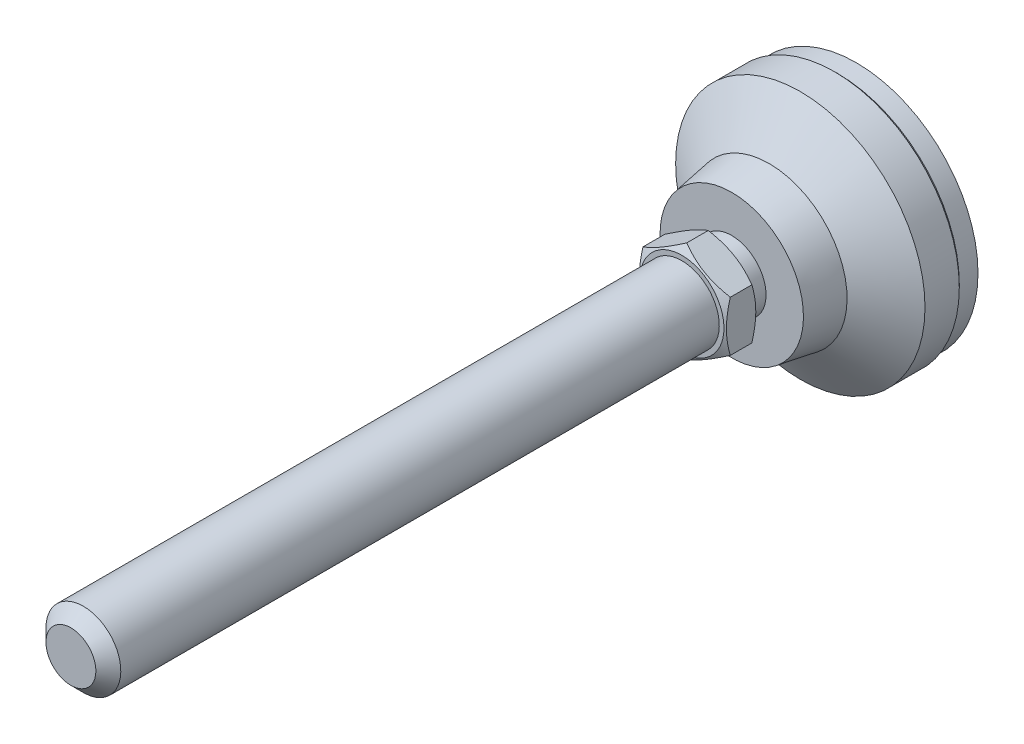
ISO-10303-21;
HEADER;
FILE_DESCRIPTION(('STEP AP214'),'2;1');
FILE_NAME('part.step','',(''),(''),'','','');
FILE_SCHEMA(('AUTOMOTIVE_DESIGN { 1 0 10303 214 1 1 1 1 }'));
ENDSEC;
DATA;
#1=APPLICATION_CONTEXT('core data for automotive mechanical design processes');
#2=APPLICATION_PROTOCOL_DEFINITION('international standard','automotive_design',2000,#1);
#3=PRODUCT_CONTEXT('',#1,'mechanical');
#4=PRODUCT('Part','Part','',(#3));
#5=PRODUCT_RELATED_PRODUCT_CATEGORY('part','',(#4));
#6=PRODUCT_DEFINITION_FORMATION('','',#4);
#7=PRODUCT_DEFINITION_CONTEXT('part definition',#1,'design');
#8=PRODUCT_DEFINITION('design','',#6,#7);
#9=PRODUCT_DEFINITION_SHAPE('','',#8);
#10=(LENGTH_UNIT() NAMED_UNIT(*) SI_UNIT(.MILLI.,.METRE.));
#11=(NAMED_UNIT(*) PLANE_ANGLE_UNIT() SI_UNIT($,.RADIAN.));
#12=(NAMED_UNIT(*) SI_UNIT($,.STERADIAN.) SOLID_ANGLE_UNIT());
#13=UNCERTAINTY_MEASURE_WITH_UNIT(LENGTH_MEASURE(1.E-05),#10,'distance_accuracy_value','');
#14=(GEOMETRIC_REPRESENTATION_CONTEXT(3) GLOBAL_UNCERTAINTY_ASSIGNED_CONTEXT((#13)) GLOBAL_UNIT_ASSIGNED_CONTEXT((#10,
#11,#12)) REPRESENTATION_CONTEXT('',''));
#15=CARTESIAN_POINT('',(0.,0.,0.));
#16=DIRECTION('',(0.,0.,1.));
#17=DIRECTION('',(1.,0.,0.));
#18=AXIS2_PLACEMENT_3D('',#15,#16,#17);
#19=CARTESIAN_POINT('',(0.,0.,1.99999999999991));
#20=DIRECTION('',(0.,0.,-1.));
#21=DIRECTION('',(0.,1.,0.));
#22=AXIS2_PLACEMENT_3D('',#19,#20,#21);
#23=CYLINDRICAL_SURFACE('',#22,20.);
#24=CARTESIAN_POINT('',(0.,0.,3.5));
#25=DIRECTION('',(0.,0.,-1.));
#26=DIRECTION('',(0.,1.,0.));
#27=AXIS2_PLACEMENT_3D('',#24,#25,#26);
#28=CIRCLE('',#27,20.);
#29=CARTESIAN_POINT('',(0.,20.,3.5));
#30=VERTEX_POINT('',#29);
#31=EDGE_CURVE('E114',#30,#30,#28,.F.);
#32=ORIENTED_EDGE('',*,*,#31,.T.);
#33=EDGE_LOOP('',(#32));
#34=FACE_BOUND('',#33,.T.);
#35=CARTESIAN_POINT('',(0.,0.,9.));
#36=DIRECTION('',(0.,0.,-1.));
#37=DIRECTION('',(0.,1.,0.));
#38=AXIS2_PLACEMENT_3D('',#35,#36,#37);
#39=CIRCLE('',#38,20.);
#40=CARTESIAN_POINT('',(0.,20.,9.));
#41=VERTEX_POINT('',#40);
#42=EDGE_CURVE('E108',#41,#41,#39,.T.);
#43=ORIENTED_EDGE('',*,*,#42,.T.);
#44=EDGE_LOOP('',(#43));
#45=FACE_BOUND('',#44,.T.);
#46=ADVANCED_FACE('F14',(#34,#45),#23,.T.);
#47=CARTESIAN_POINT('',(0.,0.,14.));
#48=DIRECTION('',(0.,0.,-1.));
#49=DIRECTION('',(0.,1.,0.));
#50=AXIS2_PLACEMENT_3D('',#47,#48,#49);
#51=CONICAL_SURFACE('',#50,12.5,0.98279372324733);
#52=ORIENTED_EDGE('',*,*,#42,.F.);
#53=EDGE_LOOP('',(#52));
#54=FACE_BOUND('',#53,.T.);
#55=CARTESIAN_POINT('',(0.,0.,14.));
#56=DIRECTION('',(0.,0.,-1.));
#57=DIRECTION('',(0.,1.,0.));
#58=AXIS2_PLACEMENT_3D('',#55,#56,#57);
#59=CIRCLE('',#58,12.5);
#60=CARTESIAN_POINT('',(0.,12.5,14.));
#61=VERTEX_POINT('',#60);
#62=EDGE_CURVE('E105',#61,#61,#59,.T.);
#63=ORIENTED_EDGE('',*,*,#62,.T.);
#64=EDGE_LOOP('',(#63));
#65=FACE_BOUND('',#64,.T.);
#66=ADVANCED_FACE('F226',(#54,#65),#51,.T.);
#67=CARTESIAN_POINT('',(0.,0.,20.));
#68=DIRECTION('',(0.,0.,-1.));
#69=DIRECTION('',(0.,1.,0.));
#70=AXIS2_PLACEMENT_3D('',#67,#68,#69);
#71=CONICAL_SURFACE('',#70,11.5,0.165148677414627);
#72=ORIENTED_EDGE('',*,*,#62,.F.);
#73=EDGE_LOOP('',(#72));
#74=FACE_BOUND('',#73,.T.);
#75=CARTESIAN_POINT('',(0.,0.,20.));
#76=DIRECTION('',(0.,0.,-1.));
#77=DIRECTION('',(0.,1.,0.));
#78=AXIS2_PLACEMENT_3D('',#75,#76,#77);
#79=CIRCLE('',#78,11.5);
#80=CARTESIAN_POINT('',(0.,11.5,20.));
#81=VERTEX_POINT('',#80);
#82=EDGE_CURVE('E102',#81,#81,#79,.T.);
#83=ORIENTED_EDGE('',*,*,#82,.T.);
#84=EDGE_LOOP('',(#83));
#85=FACE_BOUND('',#84,.T.);
#86=ADVANCED_FACE('F222',(#74,#85),#71,.T.);
#87=CARTESIAN_POINT('',(-11.5,0.,20.));
#88=DIRECTION('',(0.,0.,-1.));
#89=DIRECTION('',(0.,1.,0.));
#90=AXIS2_PLACEMENT_3D('',#87,#88,#89);
#91=PLANE('',#90);
#92=ORIENTED_EDGE('',*,*,#82,.F.);
#93=EDGE_LOOP('',(#92));
#94=FACE_BOUND('',#93,.T.);
#95=CARTESIAN_POINT('',(0.,0.,20.));
#96=DIRECTION('',(0.,0.,-1.));
#97=DIRECTION('',(0.,1.,0.));
#98=AXIS2_PLACEMENT_3D('',#95,#96,#97);
#99=CIRCLE('',#98,5.49999999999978);
#100=CARTESIAN_POINT('',(0.,5.49999999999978,20.));
#101=VERTEX_POINT('',#100);
#102=EDGE_CURVE('E99',#101,#101,#99,.T.);
#103=ORIENTED_EDGE('',*,*,#102,.T.);
#104=EDGE_LOOP('',(#103));
#105=FACE_BOUND('',#104,.T.);
#106=ADVANCED_FACE('F218',(#94,#105),#91,.F.);
#107=CARTESIAN_POINT('',(0.,0.,1.99999999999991));
#108=DIRECTION('',(0.,0.,-1.));
#109=DIRECTION('',(0.,1.,0.));
#110=AXIS2_PLACEMENT_3D('',#107,#108,#109);
#111=CYLINDRICAL_SURFACE('',#110,5.49999999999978);
#112=ORIENTED_EDGE('',*,*,#102,.F.);
#113=EDGE_LOOP('',(#112));
#114=FACE_BOUND('',#113,.T.);
#115=CARTESIAN_POINT('',(0.,0.,23.));
#116=DIRECTION('',(0.,0.,-1.));
#117=DIRECTION('',(0.,1.,0.));
#118=AXIS2_PLACEMENT_3D('',#115,#116,#117);
#119=CIRCLE('',#118,5.49999999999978);
#120=CARTESIAN_POINT('',(0.,5.49999999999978,23.));
#121=VERTEX_POINT('',#120);
#122=EDGE_CURVE('E96',#121,#121,#119,.T.);
#123=ORIENTED_EDGE('',*,*,#122,.T.);
#124=EDGE_LOOP('',(#123));
#125=FACE_BOUND('',#124,.T.);
#126=ADVANCED_FACE('F214',(#114,#125),#111,.T.);
#127=CARTESIAN_POINT('',(-5.49999999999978,0.,23.));
#128=DIRECTION('',(0.,0.,1.));
#129=DIRECTION('',(0.,-1.,0.));
#130=AXIS2_PLACEMENT_3D('',#127,#128,#129);
#131=PLANE('',#130);
#132=CARTESIAN_POINT('',(0.,0.,23.));
#133=DIRECTION('',(0.,0.,1.));
#134=DIRECTION('',(0.,-1.,0.));
#135=AXIS2_PLACEMENT_3D('',#132,#133,#134);
#136=CIRCLE('',#135,6.75);
#137=CARTESIAN_POINT('',(0.,-6.75,23.));
#138=VERTEX_POINT('',#137);
#139=EDGE_CURVE('E305',#138,#138,#136,.T.);
#140=ORIENTED_EDGE('',*,*,#139,.F.);
#141=EDGE_LOOP('',(#140));
#142=FACE_BOUND('',#141,.T.);
#143=ORIENTED_EDGE('',*,*,#122,.F.);
#144=EDGE_LOOP('',(#143));
#145=FACE_BOUND('',#144,.T.);
#146=ADVANCED_FACE('F211',(#142,#145),#131,.F.);
#147=CARTESIAN_POINT('',(0.,0.,3.));
#148=DIRECTION('',(0.,0.,1.));
#149=DIRECTION('',(0.,-1.,0.));
#150=AXIS2_PLACEMENT_3D('',#147,#148,#149);
#151=CONICAL_SURFACE('',#150,19.5,0.785398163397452);
#152=ORIENTED_EDGE('',*,*,#31,.F.);
#153=EDGE_LOOP('',(#152));
#154=FACE_BOUND('',#153,.T.);
#155=CARTESIAN_POINT('',(0.,0.,3.));
#156=DIRECTION('',(0.,0.,-1.));
#157=DIRECTION('',(0.,1.,0.));
#158=AXIS2_PLACEMENT_3D('',#155,#156,#157);
#159=CIRCLE('',#158,19.5);
#160=CARTESIAN_POINT('',(0.,19.5,3.));
#161=VERTEX_POINT('',#160);
#162=EDGE_CURVE('E111',#161,#161,#159,.T.);
#163=ORIENTED_EDGE('',*,*,#162,.F.);
#164=EDGE_LOOP('',(#163));
#165=FACE_BOUND('',#164,.T.);
#166=ADVANCED_FACE('F16',(#154,#165),#151,.T.);
#167=CARTESIAN_POINT('',(0.,0.,0.));
#168=DIRECTION('',(0.,0.,1.));
#169=DIRECTION('',(0.,-1.,0.));
#170=AXIS2_PLACEMENT_3D('',#167,#168,#169);
#171=CYLINDRICAL_SURFACE('',#170,19.5);
#172=CARTESIAN_POINT('',(0.,0.,0.));
#173=DIRECTION('',(0.,0.,-1.));
#174=DIRECTION('',(0.,1.,0.));
#175=AXIS2_PLACEMENT_3D('',#172,#173,#174);
#176=CIRCLE('',#175,19.5);
#177=CARTESIAN_POINT('',(0.,19.5,0.));
#178=VERTEX_POINT('',#177);
#179=EDGE_CURVE('E278',#178,#178,#176,.T.);
#180=ORIENTED_EDGE('',*,*,#179,.F.);
#181=EDGE_LOOP('',(#180));
#182=FACE_BOUND('',#181,.T.);
#183=ORIENTED_EDGE('',*,*,#162,.T.);
#184=EDGE_LOOP('',(#183));
#185=FACE_BOUND('',#184,.T.);
#186=ADVANCED_FACE('F251',(#182,#185),#171,.T.);
#187=CARTESIAN_POINT('',(0.,0.,0.));
#188=DIRECTION('',(0.,0.,-1.));
#189=DIRECTION('',(0.,1.,0.));
#190=AXIS2_PLACEMENT_3D('',#187,#188,#189);
#191=PLANE('',#190);
#192=ORIENTED_EDGE('',*,*,#179,.T.);
#193=EDGE_LOOP('',(#192));
#194=FACE_BOUND('',#193,.T.);
#195=ADVANCED_FACE('F134',(#194),#191,.T.);
#196=CARTESIAN_POINT('',(0.,0.,23.));
#197=DIRECTION('',(0.,0.,1.));
#198=DIRECTION('',(0.,-1.,0.));
#199=AXIS2_PLACEMENT_3D('',#196,#197,#198);
#200=CONICAL_SURFACE('',#199,6.75,1.0471975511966);
#201=CARTESIAN_POINT('',(0.000200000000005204,-8.08301923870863,23.7696190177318));
#202=CARTESIAN_POINT('',(-0.153667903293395,-7.99418356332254,23.7183374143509));
#203=CARTESIAN_POINT('',(-0.308109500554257,-7.90501666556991,23.669383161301));
#204=CARTESIAN_POINT('',(-0.618246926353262,-7.72595873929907,23.5767703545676));
#205=CARTESIAN_POINT('',(-0.773943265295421,-7.63606741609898,23.5331140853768));
#206=CARTESIAN_POINT('',(-1.24352516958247,-7.36495417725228,23.4109491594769));
#207=CARTESIAN_POINT('',(-1.55926433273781,-7.18266208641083,23.3414631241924));
#208=CARTESIAN_POINT('',(-2.03176224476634,-6.90986528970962,23.2599825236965));
#209=CARTESIAN_POINT('',(-2.1871092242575,-6.82017566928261,23.2367710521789));
#210=CARTESIAN_POINT('',(-2.49850511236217,-6.64039116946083,23.1978487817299));
#211=CARTESIAN_POINT('',(-2.65455395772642,-6.55029632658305,23.1821373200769));
#212=CARTESIAN_POINT('',(-2.96692267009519,-6.36995016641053,23.1586154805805));
#213=CARTESIAN_POINT('',(-3.12324202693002,-6.27969914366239,23.1507961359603));
#214=CARTESIAN_POINT('',(-3.43601650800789,-6.09911871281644,23.1432178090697));
#215=CARTESIAN_POINT('',(-3.59247162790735,-6.00878930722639,23.1434585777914));
#216=CARTESIAN_POINT('',(-4.02110687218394,-5.76131663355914,23.1551972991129));
#217=CARTESIAN_POINT('',(-4.2931466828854,-5.60425437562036,23.1749033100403));
#218=CARTESIAN_POINT('',(-4.83541944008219,-5.29117305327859,23.2373910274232));
#219=CARTESIAN_POINT('',(-5.10565047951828,-5.13515508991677,23.2801940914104));
#220=CARTESIAN_POINT('',(-5.64901454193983,-4.82144370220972,23.3871892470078));
#221=CARTESIAN_POINT('',(-5.92207900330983,-4.66378986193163,23.4518346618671));
#222=CARTESIAN_POINT('',(-6.46413578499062,-4.35083323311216,23.5985536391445));
#223=CARTESIAN_POINT('',(-6.73313504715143,-4.19552643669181,23.680592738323));
#224=CARTESIAN_POINT('',(-7.0002,-4.04133641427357,23.7696190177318));
#225=B_SPLINE_CURVE_WITH_KNOTS('',3,(#201,#202,#203,#204,#205,#206,#207,#208,#209,#210,#211,
#212,#213,#214,#215,#216,#217,#218,#219,#220,#221,#222,#223,#224),.UNSPECIFIED.,.F.,.F.,(4,2,2,
2,2,2,2,2,2,2,2,4),(0.,0.554727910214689,1.10969417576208,2.2219327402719,2.76443041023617,
3.30688013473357,3.8487128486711,4.39052882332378,5.33376515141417,6.27787517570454,
7.24292418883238,8.20607866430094),.UNSPECIFIED.);
#226=CARTESIAN_POINT('',(0.,-8.08290376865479,23.7695523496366));
#227=VERTEX_POINT('',#226);
#228=CARTESIAN_POINT('',(-7.,-4.04145188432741,23.7695523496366));
#229=VERTEX_POINT('',#228);
#230=EDGE_CURVE('E73',#227,#229,#225,.T.);
#231=ORIENTED_EDGE('',*,*,#230,.T.);
#232=CARTESIAN_POINT('',(-7.,10.8348937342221,26.5503667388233));
#233=CARTESIAN_POINT('',(-7.,10.5293318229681,26.4022261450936));
#234=CARTESIAN_POINT('',(-7.,10.2230662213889,26.2555120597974));
#235=CARTESIAN_POINT('',(-7.,9.60875332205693,25.9657396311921));
#236=CARTESIAN_POINT('',(-7.,9.30070575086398,25.8226818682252));
#237=CARTESIAN_POINT('',(-7.,8.68085739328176,25.540300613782));
#238=CARTESIAN_POINT('',(-7.,8.36904529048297,25.4010018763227));
#239=CARTESIAN_POINT('',(-7.,7.74293373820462,25.1281330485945));
#240=CARTESIAN_POINT('',(-7.,7.4286344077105,24.9945626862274));
#241=CARTESIAN_POINT('',(-7.,6.78698608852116,24.7305231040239));
#242=CARTESIAN_POINT('',(-7.,6.4595402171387,24.6002880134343));
#243=CARTESIAN_POINT('',(-7.,5.80081065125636,24.3497252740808));
#244=CARTESIAN_POINT('',(-7.,5.46952652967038,24.229398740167));
#245=CARTESIAN_POINT('',(-7.,4.80321625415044,24.0018276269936));
#246=CARTESIAN_POINT('',(-7.,4.46819930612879,23.8945563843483));
#247=CARTESIAN_POINT('',(-7.,3.79337198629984,23.6965503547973));
#248=CARTESIAN_POINT('',(-7.,3.4535631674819,23.6058103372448));
#249=CARTESIAN_POINT('',(-7.,2.77078372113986,23.4457225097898));
#250=CARTESIAN_POINT('',(-7.,2.42784084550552,23.3762595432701));
#251=CARTESIAN_POINT('',(-7.,1.91032039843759,23.2910407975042));
#252=CARTESIAN_POINT('',(-7.,1.73728303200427,23.2657960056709));
#253=CARTESIAN_POINT('',(-7.,1.39035535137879,23.222127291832));
#254=CARTESIAN_POINT('',(-7.,1.2164651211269,23.203702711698));
#255=CARTESIAN_POINT('',(-7.,0.870327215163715,23.1742714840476));
#256=CARTESIAN_POINT('',(-7.,0.698087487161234,23.1631717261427));
#257=CARTESIAN_POINT('',(-7.,0.35329310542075,23.1482643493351));
#258=CARTESIAN_POINT('',(-7.,0.180738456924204,23.1444566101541));
#259=CARTESIAN_POINT('',(-7.,-0.164377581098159,23.1442240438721));
#260=CARTESIAN_POINT('',(-7.,-0.33693897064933,23.1477992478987));
#261=CARTESIAN_POINT('',(-7.,-0.681758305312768,23.1622455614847));
#262=CARTESIAN_POINT('',(-7.,-0.854016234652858,23.1731170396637));
#263=CARTESIAN_POINT('',(-7.,-1.26863959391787,23.2078365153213));
#264=CARTESIAN_POINT('',(-7.,-1.51071829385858,23.2351816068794));
#265=CARTESIAN_POINT('',(-7.,-1.99305383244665,23.3027847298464));
#266=CARTESIAN_POINT('',(-7.,-2.23331041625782,23.3430445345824));
#267=CARTESIAN_POINT('',(-7.,-2.95108635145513,23.4810590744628));
#268=CARTESIAN_POINT('',(-7.,-3.42533906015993,23.5960230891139));
#269=CARTESIAN_POINT('',(-7.,-4.13444792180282,23.7950671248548));
#270=CARTESIAN_POINT('',(-7.,-4.3729900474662,23.8667681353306));
#271=CARTESIAN_POINT('',(-7.,-4.84775684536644,24.0175391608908));
#272=CARTESIAN_POINT('',(-7.,-5.08398150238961,24.0966092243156));
#273=CARTESIAN_POINT('',(-7.,-5.55418919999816,24.260856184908));
#274=CARTESIAN_POINT('',(-7.,-5.78817296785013,24.3460310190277));
#275=CARTESIAN_POINT('',(-7.,-6.25420710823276,24.5214931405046));
#276=CARTESIAN_POINT('',(-7.,-6.48625750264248,24.611780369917));
#277=CARTESIAN_POINT('',(-7.,-7.03079375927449,24.8294575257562));
#278=CARTESIAN_POINT('',(-7.,-7.34256475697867,24.9586323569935));
#279=CARTESIAN_POINT('',(-7.,-7.96348332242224,25.2231582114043));
#280=CARTESIAN_POINT('',(-7.,-8.27263073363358,25.3585096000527));
#281=CARTESIAN_POINT('',(-7.,-8.88878070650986,25.6341566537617));
#282=CARTESIAN_POINT('',(-7.,-9.19578283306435,25.7744532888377));
#283=CARTESIAN_POINT('',(-7.,-9.80794886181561,26.0590082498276));
#284=CARTESIAN_POINT('',(-7.,-10.1131127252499,26.2032666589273));
#285=CARTESIAN_POINT('',(-7.,-10.7222145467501,26.4951564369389));
#286=CARTESIAN_POINT('',(-7.,-11.0261508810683,26.6427911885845));
#287=CARTESIAN_POINT('',(-7.,-11.6327197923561,26.9407175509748));
#288=CARTESIAN_POINT('',(-7.,-11.9353523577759,27.0910091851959));
#289=CARTESIAN_POINT('',(-7.,-12.8415253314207,27.5451278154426));
#290=CARTESIAN_POINT('',(-7.,-13.4434207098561,27.8522370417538));
#291=CARTESIAN_POINT('',(-7.,-14.594154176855,28.4468576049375));
#292=CARTESIAN_POINT('',(-7.,-15.1432469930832,28.7338781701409));
#293=CARTESIAN_POINT('',(-7.,-16.2393904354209,29.3118355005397));
#294=CARTESIAN_POINT('',(-7.,-16.7864409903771,29.6027724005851));
#295=CARTESIAN_POINT('',(-7.,-17.8776073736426,30.1869146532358));
#296=CARTESIAN_POINT('',(-7.,-18.4217271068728,30.4801127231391));
#297=CARTESIAN_POINT('',(-7.,-19.5086591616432,31.0688532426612));
#298=CARTESIAN_POINT('',(-7.,-20.0514715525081,31.3643955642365));
#299=CARTESIAN_POINT('',(-7.,-20.5938019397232,31.6608138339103));
#300=B_SPLINE_CURVE_WITH_KNOTS('',3,(#232,#233,#234,#235,#236,#237,#238,#239,#240,#241,#242,
#243,#244,#245,#246,#247,#248,#249,#250,#251,#252,#253,#254,#255,#256,#257,#258,#259,#260,#261,
#262,#263,#264,#265,#266,#267,#268,#269,#270,#271,#272,#273,#274,#275,#276,#277,#278,#279,#280,
#281,#282,#283,#284,#285,#286,#287,#288,#289,#290,#291,#292,#293,#294,#295,#296,#297,#298,#299),
.UNSPECIFIED.,.F.,.F.,(4,2,2,2,2,2,2,2,2,2,2,2,2,2,2,2,2,2,2,2,2,2,2,2,2,2,2,2,2,2,2,2,2,4),(0.,
1.01874874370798,2.03765819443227,3.06215014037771,4.08659336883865,5.14365285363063,
6.2008311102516,7.25581266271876,8.31045982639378,9.35929379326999,9.88378805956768,
10.4082317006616,10.9258733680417,11.4435064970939,11.9611418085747,12.4788032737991,
13.2092448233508,13.9397867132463,15.4016889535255,16.1488828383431,16.8960816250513,
17.6430290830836,18.3899680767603,19.4022943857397,20.4146806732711,21.4272666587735,
22.4398739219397,23.4535444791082,24.4672239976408,26.4943175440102,28.3530512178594,
30.211849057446,32.0661035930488,33.9202575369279),.UNSPECIFIED.);
#301=CARTESIAN_POINT('',(-7.,4.04145188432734,23.7695523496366));
#302=VERTEX_POINT('',#301);
#303=EDGE_CURVE('E81',#229,#302,#300,.F.);
#304=ORIENTED_EDGE('',*,*,#303,.T.);
#305=CARTESIAN_POINT('',(-7.0002,4.0413364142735,23.7696190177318));
#306=CARTESIAN_POINT('',(-6.8463320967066,4.13017208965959,23.7183374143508));
#307=CARTESIAN_POINT('',(-6.69189049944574,4.21933898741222,23.669383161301));
#308=CARTESIAN_POINT('',(-6.38175307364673,4.39839691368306,23.5767703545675));
#309=CARTESIAN_POINT('',(-6.22605673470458,4.48828823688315,23.5331140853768));
#310=CARTESIAN_POINT('',(-5.75647483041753,4.75940147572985,23.4109491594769));
#311=CARTESIAN_POINT('',(-5.44073566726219,4.94169356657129,23.3414631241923));
#312=CARTESIAN_POINT('',(-4.96823775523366,5.2144903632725,23.2599825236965));
#313=CARTESIAN_POINT('',(-4.81289077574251,5.30417998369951,23.2367710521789));
#314=CARTESIAN_POINT('',(-4.50149488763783,5.48396448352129,23.1978487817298));
#315=CARTESIAN_POINT('',(-4.34544604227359,5.57405932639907,23.1821373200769));
#316=CARTESIAN_POINT('',(-4.03307732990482,5.75440548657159,23.1586154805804));
#317=CARTESIAN_POINT('',(-3.87675797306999,5.84465650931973,23.1507961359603));
#318=CARTESIAN_POINT('',(-3.56398349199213,6.02523694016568,23.1432178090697));
#319=CARTESIAN_POINT('',(-3.40752837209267,6.11556634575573,23.1434585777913));
#320=CARTESIAN_POINT('',(-2.97889312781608,6.36303901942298,23.1551972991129));
#321=CARTESIAN_POINT('',(-2.70685331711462,6.52010127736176,23.1749033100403));
#322=CARTESIAN_POINT('',(-2.16458055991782,6.83318259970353,23.2373910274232));
#323=CARTESIAN_POINT('',(-1.89434952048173,6.98920056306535,23.2801940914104));
#324=CARTESIAN_POINT('',(-1.35098545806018,7.3029119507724,23.3871892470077));
#325=CARTESIAN_POINT('',(-1.07792099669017,7.4605657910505,23.4518346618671));
#326=CARTESIAN_POINT('',(-0.53586421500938,7.77352241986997,23.5985536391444));
#327=CARTESIAN_POINT('',(-0.266864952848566,7.92882921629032,23.6805927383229));
#328=CARTESIAN_POINT('',(0.000200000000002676,8.08301923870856,23.7696190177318));
#329=B_SPLINE_CURVE_WITH_KNOTS('',3,(#305,#306,#307,#308,#309,#310,#311,#312,#313,#314,#315,
#316,#317,#318,#319,#320,#321,#322,#323,#324,#325,#326,#327,#328),.UNSPECIFIED.,.F.,.F.,(4,2,2,
2,2,2,2,2,2,2,2,4),(0.,0.554727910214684,1.10969417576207,2.22193274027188,2.76443041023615,
3.30688013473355,3.84871284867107,4.39052882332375,5.33376515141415,6.27787517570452,
7.24292418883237,8.20607866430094),.UNSPECIFIED.);
#330=CARTESIAN_POINT('',(0.,8.08290376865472,23.7695523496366));
#331=VERTEX_POINT('',#330);
#332=EDGE_CURVE('E193',#302,#331,#329,.T.);
#333=ORIENTED_EDGE('',*,*,#332,.T.);
#334=CARTESIAN_POINT('',(-0.000199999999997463,8.08301923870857,23.7696190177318));
#335=CARTESIAN_POINT('',(0.153667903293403,7.99418356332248,23.7183374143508));
#336=CARTESIAN_POINT('',(0.308109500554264,7.90501666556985,23.669383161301));
#337=CARTESIAN_POINT('',(0.618246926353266,7.72595873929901,23.5767703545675));
#338=CARTESIAN_POINT('',(0.773943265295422,7.63606741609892,23.5331140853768));
#339=CARTESIAN_POINT('',(1.24352516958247,7.36495417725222,23.4109491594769));
#340=CARTESIAN_POINT('',(1.55926433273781,7.18266208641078,23.3414631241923));
#341=CARTESIAN_POINT('',(2.03176224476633,6.90986528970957,23.2599825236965));
#342=CARTESIAN_POINT('',(2.18710922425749,6.82017566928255,23.2367710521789));
#343=CARTESIAN_POINT('',(2.49850511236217,6.64039116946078,23.1978487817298));
#344=CARTESIAN_POINT('',(2.65455395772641,6.550296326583,23.1821373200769));
#345=CARTESIAN_POINT('',(2.96692267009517,6.36995016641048,23.1586154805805));
#346=CARTESIAN_POINT('',(3.12324202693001,6.27969914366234,23.1507961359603));
#347=CARTESIAN_POINT('',(3.43601650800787,6.09911871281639,23.1432178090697));
#348=CARTESIAN_POINT('',(3.59247162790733,6.00878930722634,23.1434585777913));
#349=CARTESIAN_POINT('',(4.02110687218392,5.76131663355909,23.1551972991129));
#350=CARTESIAN_POINT('',(4.29314668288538,5.60425437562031,23.1749033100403));
#351=CARTESIAN_POINT('',(4.83541944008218,5.29117305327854,23.2373910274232));
#352=CARTESIAN_POINT('',(5.10565047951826,5.13515508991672,23.2801940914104));
#353=CARTESIAN_POINT('',(5.64901454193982,4.82144370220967,23.3871892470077));
#354=CARTESIAN_POINT('',(5.92207900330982,4.66378986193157,23.4518346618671));
#355=CARTESIAN_POINT('',(6.46413578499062,4.35083323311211,23.5985536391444));
#356=CARTESIAN_POINT('',(6.73313504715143,4.19552643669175,23.6805927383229));
#357=CARTESIAN_POINT('',(7.0002,4.04133641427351,23.7696190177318));
#358=B_SPLINE_CURVE_WITH_KNOTS('',3,(#334,#335,#336,#337,#338,#339,#340,#341,#342,#343,#344,
#345,#346,#347,#348,#349,#350,#351,#352,#353,#354,#355,#356,#357),.UNSPECIFIED.,.F.,.F.,(4,2,2,
2,2,2,2,2,2,2,2,4),(0.,0.554727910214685,1.10969417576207,2.22193274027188,2.76443041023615,
3.30688013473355,3.84871284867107,4.39052882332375,5.33376515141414,6.27787517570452,
7.24292418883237,8.20607866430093),.UNSPECIFIED.);
#359=CARTESIAN_POINT('',(7.,4.04145188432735,23.7695523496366));
#360=VERTEX_POINT('',#359);
#361=EDGE_CURVE('E304',#331,#360,#358,.T.);
#362=ORIENTED_EDGE('',*,*,#361,.T.);
#363=CARTESIAN_POINT('',(7.,10.8348937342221,26.5503667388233));
#364=CARTESIAN_POINT('',(7.,10.5293318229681,26.4022261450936));
#365=CARTESIAN_POINT('',(7.,10.2230662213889,26.2555120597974));
#366=CARTESIAN_POINT('',(7.,9.60875332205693,25.9657396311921));
#367=CARTESIAN_POINT('',(7.,9.30070575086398,25.8226818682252));
#368=CARTESIAN_POINT('',(7.,8.68085739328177,25.540300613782));
#369=CARTESIAN_POINT('',(7.,8.36904529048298,25.4010018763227));
#370=CARTESIAN_POINT('',(7.,7.74293373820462,25.1281330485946));
#371=CARTESIAN_POINT('',(7.,7.4286344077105,24.9945626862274));
#372=CARTESIAN_POINT('',(7.,6.78698608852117,24.7305231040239));
#373=CARTESIAN_POINT('',(7.,6.4595402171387,24.6002880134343));
#374=CARTESIAN_POINT('',(7.,5.80081065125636,24.3497252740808));
#375=CARTESIAN_POINT('',(7.,5.46952652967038,24.229398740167));
#376=CARTESIAN_POINT('',(7.,4.80321625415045,24.0018276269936));
#377=CARTESIAN_POINT('',(7.,4.46819930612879,23.8945563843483));
#378=CARTESIAN_POINT('',(7.,3.79337198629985,23.6965503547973));
#379=CARTESIAN_POINT('',(7.,3.4535631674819,23.6058103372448));
#380=CARTESIAN_POINT('',(7.,2.77078372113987,23.4457225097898));
#381=CARTESIAN_POINT('',(7.,2.42784084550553,23.3762595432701));
#382=CARTESIAN_POINT('',(7.,1.91032039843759,23.2910407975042));
#383=CARTESIAN_POINT('',(7.,1.73728303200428,23.2657960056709));
#384=CARTESIAN_POINT('',(7.,1.3903553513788,23.222127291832));
#385=CARTESIAN_POINT('',(7.,1.2164651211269,23.203702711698));
#386=CARTESIAN_POINT('',(7.,0.87032721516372,23.1742714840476));
#387=CARTESIAN_POINT('',(7.,0.698087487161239,23.1631717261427));
#388=CARTESIAN_POINT('',(7.,0.353293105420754,23.1482643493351));
#389=CARTESIAN_POINT('',(7.,0.180738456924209,23.1444566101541));
#390=CARTESIAN_POINT('',(7.,-0.164377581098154,23.1442240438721));
#391=CARTESIAN_POINT('',(7.,-0.336938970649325,23.1477992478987));
#392=CARTESIAN_POINT('',(7.,-0.681758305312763,23.1622455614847));
#393=CARTESIAN_POINT('',(7.,-0.854016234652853,23.1731170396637));
#394=CARTESIAN_POINT('',(7.,-1.26863959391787,23.2078365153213));
#395=CARTESIAN_POINT('',(7.,-1.51071829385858,23.2351816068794));
#396=CARTESIAN_POINT('',(7.,-1.99305383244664,23.3027847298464));
#397=CARTESIAN_POINT('',(7.,-2.23331041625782,23.3430445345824));
#398=CARTESIAN_POINT('',(7.,-2.95108635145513,23.4810590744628));
#399=CARTESIAN_POINT('',(7.,-3.42533906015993,23.5960230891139));
#400=CARTESIAN_POINT('',(7.,-4.13444792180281,23.7950671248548));
#401=CARTESIAN_POINT('',(7.,-4.37299004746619,23.8667681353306));
#402=CARTESIAN_POINT('',(7.,-4.84775684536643,24.0175391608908));
#403=CARTESIAN_POINT('',(7.,-5.08398150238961,24.0966092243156));
#404=CARTESIAN_POINT('',(7.,-5.55418919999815,24.260856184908));
#405=CARTESIAN_POINT('',(7.,-5.78817296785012,24.3460310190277));
#406=CARTESIAN_POINT('',(7.,-6.25420710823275,24.5214931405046));
#407=CARTESIAN_POINT('',(7.,-6.48625750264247,24.611780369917));
#408=CARTESIAN_POINT('',(7.,-7.03079375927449,24.8294575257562));
#409=CARTESIAN_POINT('',(7.,-7.34256475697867,24.9586323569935));
#410=CARTESIAN_POINT('',(7.,-7.96348332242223,25.2231582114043));
#411=CARTESIAN_POINT('',(7.,-8.27263073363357,25.3585096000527));
#412=CARTESIAN_POINT('',(7.,-8.88878070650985,25.6341566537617));
#413=CARTESIAN_POINT('',(7.,-9.19578283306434,25.7744532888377));
#414=CARTESIAN_POINT('',(7.,-9.80794886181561,26.0590082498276));
#415=CARTESIAN_POINT('',(7.,-10.1131127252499,26.2032666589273));
#416=CARTESIAN_POINT('',(7.,-10.7222145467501,26.4951564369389));
#417=CARTESIAN_POINT('',(7.,-11.0261508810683,26.6427911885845));
#418=CARTESIAN_POINT('',(7.,-11.6327197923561,26.9407175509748));
#419=CARTESIAN_POINT('',(7.,-11.9353523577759,27.0910091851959));
#420=CARTESIAN_POINT('',(7.,-12.8415253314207,27.5451278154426));
#421=CARTESIAN_POINT('',(7.,-13.4434207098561,27.8522370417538));
#422=CARTESIAN_POINT('',(7.,-14.594154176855,28.4468576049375));
#423=CARTESIAN_POINT('',(7.,-15.1432469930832,28.7338781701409));
#424=CARTESIAN_POINT('',(7.,-16.2393904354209,29.3118355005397));
#425=CARTESIAN_POINT('',(7.,-16.7864409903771,29.6027724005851));
#426=CARTESIAN_POINT('',(7.,-17.8776073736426,30.1869146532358));
#427=CARTESIAN_POINT('',(7.,-18.4217271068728,30.4801127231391));
#428=CARTESIAN_POINT('',(7.,-19.5086591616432,31.0688532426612));
#429=CARTESIAN_POINT('',(7.,-20.0514715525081,31.3643955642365));
#430=CARTESIAN_POINT('',(7.,-20.5938019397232,31.6608138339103));
#431=B_SPLINE_CURVE_WITH_KNOTS('',3,(#363,#364,#365,#366,#367,#368,#369,#370,#371,#372,#373,
#374,#375,#376,#377,#378,#379,#380,#381,#382,#383,#384,#385,#386,#387,#388,#389,#390,#391,#392,
#393,#394,#395,#396,#397,#398,#399,#400,#401,#402,#403,#404,#405,#406,#407,#408,#409,#410,#411,
#412,#413,#414,#415,#416,#417,#418,#419,#420,#421,#422,#423,#424,#425,#426,#427,#428,#429,#430),
.UNSPECIFIED.,.F.,.F.,(4,2,2,2,2,2,2,2,2,2,2,2,2,2,2,2,2,2,2,2,2,2,2,2,2,2,2,2,2,2,2,2,2,4),(0.,
1.01874874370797,2.03765819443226,3.0621501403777,4.08659336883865,5.14365285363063,
6.20083111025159,7.25581266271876,8.31045982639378,9.35929379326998,9.88378805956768,
10.4082317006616,10.9258733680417,11.4435064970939,11.9611418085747,12.4788032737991,
13.2092448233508,13.9397867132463,15.4016889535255,16.1488828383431,16.8960816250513,
17.6430290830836,18.3899680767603,19.4022943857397,20.4146806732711,21.4272666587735,
22.4398739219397,23.4535444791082,24.4672239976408,26.4943175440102,28.3530512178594,
30.211849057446,32.0661035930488,33.9202575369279),.UNSPECIFIED.);
#432=CARTESIAN_POINT('',(7.,-4.04145188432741,23.7695523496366));
#433=VERTEX_POINT('',#432);
#434=EDGE_CURVE('E34',#360,#433,#431,.T.);
#435=ORIENTED_EDGE('',*,*,#434,.T.);
#436=CARTESIAN_POINT('',(7.0002,-4.04133641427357,23.7696190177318));
#437=CARTESIAN_POINT('',(6.8463320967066,-4.13017208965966,23.7183374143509));
#438=CARTESIAN_POINT('',(6.69189049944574,-4.2193389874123,23.669383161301));
#439=CARTESIAN_POINT('',(6.38175307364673,-4.39839691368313,23.5767703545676));
#440=CARTESIAN_POINT('',(6.22605673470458,-4.48828823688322,23.5331140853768));
#441=CARTESIAN_POINT('',(5.75647483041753,-4.75940147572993,23.4109491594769));
#442=CARTESIAN_POINT('',(5.44073566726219,-4.94169356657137,23.3414631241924));
#443=CARTESIAN_POINT('',(4.96823775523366,-5.21449036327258,23.2599825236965));
#444=CARTESIAN_POINT('',(4.8128907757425,-5.30417998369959,23.2367710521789));
#445=CARTESIAN_POINT('',(4.50149488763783,-5.48396448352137,23.1978487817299));
#446=CARTESIAN_POINT('',(4.34544604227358,-5.57405932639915,23.1821373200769));
#447=CARTESIAN_POINT('',(4.03307732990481,-5.75440548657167,23.1586154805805));
#448=CARTESIAN_POINT('',(3.87675797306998,-5.84465650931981,23.1507961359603));
#449=CARTESIAN_POINT('',(3.56398349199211,-6.02523694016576,23.1432178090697));
#450=CARTESIAN_POINT('',(3.40752837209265,-6.11556634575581,23.1434585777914));
#451=CARTESIAN_POINT('',(2.97889312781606,-6.36303901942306,23.1551972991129));
#452=CARTESIAN_POINT('',(2.7068533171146,-6.52010127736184,23.1749033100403));
#453=CARTESIAN_POINT('',(2.16458055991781,-6.83318259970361,23.2373910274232));
#454=CARTESIAN_POINT('',(1.89434952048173,-6.98920056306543,23.2801940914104));
#455=CARTESIAN_POINT('',(1.35098545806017,-7.30291195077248,23.3871892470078));
#456=CARTESIAN_POINT('',(1.07792099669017,-7.46056579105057,23.4518346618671));
#457=CARTESIAN_POINT('',(0.535864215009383,-7.77352241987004,23.5985536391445));
#458=CARTESIAN_POINT('',(0.266864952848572,-7.92882921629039,23.680592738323));
#459=CARTESIAN_POINT('',(-0.000199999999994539,-8.08301923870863,23.7696190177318));
#460=B_SPLINE_CURVE_WITH_KNOTS('',3,(#436,#437,#438,#439,#440,#441,#442,#443,#444,#445,#446,
#447,#448,#449,#450,#451,#452,#453,#454,#455,#456,#457,#458,#459),.UNSPECIFIED.,.F.,.F.,(4,2,2,
2,2,2,2,2,2,2,2,4),(0.,0.554727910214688,1.10969417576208,2.22193274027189,2.76443041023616,
3.30688013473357,3.84871284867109,4.39052882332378,5.33376515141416,6.27787517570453,
7.24292418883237,8.20607866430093),.UNSPECIFIED.);
#461=EDGE_CURVE('E9',#433,#227,#460,.T.);
#462=ORIENTED_EDGE('',*,*,#461,.T.);
#463=EDGE_LOOP('',(#231,#304,#333,#362,#435,#462));
#464=FACE_BOUND('',#463,.T.);
#465=ORIENTED_EDGE('',*,*,#139,.T.);
#466=EDGE_LOOP('',(#465));
#467=FACE_BOUND('',#466,.T.);
#468=ADVANCED_FACE('F71',(#464,#467),#200,.T.);
#469=CARTESIAN_POINT('',(0.,0.,126.));
#470=DIRECTION('',(0.,0.,-1.));
#471=DIRECTION('',(0.,1.,0.));
#472=AXIS2_PLACEMENT_3D('',#469,#470,#471);
#473=PLANE('',#472);
#474=CARTESIAN_POINT('',(0.,0.,126.));
#475=DIRECTION('',(0.,0.,-1.));
#476=DIRECTION('',(0.,1.,0.));
#477=AXIS2_PLACEMENT_3D('',#474,#475,#476);
#478=CIRCLE('',#477,4.);
#479=CARTESIAN_POINT('',(0.,4.,126.));
#480=VERTEX_POINT('',#479);
#481=EDGE_CURVE('E87',#480,#480,#478,.T.);
#482=ORIENTED_EDGE('',*,*,#481,.F.);
#483=EDGE_LOOP('',(#482));
#484=FACE_BOUND('',#483,.T.);
#485=ADVANCED_FACE('F183',(#484),#473,.F.);
#486=CARTESIAN_POINT('',(0.,0.,126.));
#487=DIRECTION('',(0.,0.,-1.));
#488=DIRECTION('',(0.,1.,0.));
#489=AXIS2_PLACEMENT_3D('',#486,#487,#488);
#490=CONICAL_SURFACE('',#489,4.,0.785398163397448);
#491=CARTESIAN_POINT('',(0.,0.,124.));
#492=DIRECTION('',(0.,0.,-1.));
#493=DIRECTION('',(0.,1.,0.));
#494=AXIS2_PLACEMENT_3D('',#491,#492,#493);
#495=CIRCLE('',#494,6.);
#496=CARTESIAN_POINT('',(0.,6.,124.));
#497=VERTEX_POINT('',#496);
#498=EDGE_CURVE('E92',#497,#497,#495,.T.);
#499=ORIENTED_EDGE('',*,*,#498,.F.);
#500=EDGE_LOOP('',(#499));
#501=FACE_BOUND('',#500,.T.);
#502=ORIENTED_EDGE('',*,*,#481,.T.);
#503=EDGE_LOOP('',(#502));
#504=FACE_BOUND('',#503,.T.);
#505=ADVANCED_FACE('F264',(#501,#504),#490,.T.);
#506=CARTESIAN_POINT('',(0.,0.,-4.74975615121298));
#507=DIRECTION('',(0.,0.,-1.));
#508=DIRECTION('',(0.,1.,0.));
#509=AXIS2_PLACEMENT_3D('',#506,#507,#508);
#510=CYLINDRICAL_SURFACE('',#509,6.);
#511=CARTESIAN_POINT('',(0.,0.,28.));
#512=DIRECTION('',(0.,0.,-1.));
#513=DIRECTION('',(0.,1.,0.));
#514=AXIS2_PLACEMENT_3D('',#511,#512,#513);
#515=CIRCLE('',#514,6.);
#516=CARTESIAN_POINT('',(0.,6.,28.));
#517=VERTEX_POINT('',#516);
#518=EDGE_CURVE('E117',#517,#517,#515,.F.);
#519=ORIENTED_EDGE('',*,*,#518,.T.);
#520=EDGE_LOOP('',(#519));
#521=FACE_BOUND('',#520,.T.);
#522=ORIENTED_EDGE('',*,*,#498,.T.);
#523=EDGE_LOOP('',(#522));
#524=FACE_BOUND('',#523,.T.);
#525=ADVANCED_FACE('F209',(#521,#524),#510,.T.);
#526=CARTESIAN_POINT('',(-3.99999999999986,0.,28.));
#527=DIRECTION('',(0.,0.,-1.));
#528=DIRECTION('',(0.,1.,0.));
#529=AXIS2_PLACEMENT_3D('',#526,#527,#528);
#530=PLANE('',#529);
#531=CARTESIAN_POINT('',(0.,0.,28.));
#532=DIRECTION('',(0.,0.,1.));
#533=DIRECTION('',(0.,-1.,0.));
#534=AXIS2_PLACEMENT_3D('',#531,#532,#533);
#535=CIRCLE('',#534,6.75);
#536=CARTESIAN_POINT('',(0.,-6.75,28.));
#537=VERTEX_POINT('',#536);
#538=EDGE_CURVE('E80',#537,#537,#535,.T.);
#539=ORIENTED_EDGE('',*,*,#538,.T.);
#540=EDGE_LOOP('',(#539));
#541=FACE_BOUND('',#540,.T.);
#542=ORIENTED_EDGE('',*,*,#518,.F.);
#543=EDGE_LOOP('',(#542));
#544=FACE_BOUND('',#543,.T.);
#545=ADVANCED_FACE('F131',(#541,#544),#530,.F.);
#546=CARTESIAN_POINT('',(0.,0.,26.2502690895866));
#547=DIRECTION('',(0.,0.,-1.));
#548=DIRECTION('',(0.,1.,0.));
#549=AXIS2_PLACEMENT_3D('',#546,#547,#548);
#550=CONICAL_SURFACE('',#549,9.78062283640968,1.0471975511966);
#551=CARTESIAN_POINT('',(-7.0002,-4.04133641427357,27.230380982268));
#552=CARTESIAN_POINT('',(-6.84633209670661,-4.13017208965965,27.281662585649));
#553=CARTESIAN_POINT('',(-6.69189049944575,-4.21933898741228,27.3306168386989));
#554=CARTESIAN_POINT('',(-6.38175307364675,-4.39839691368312,27.4232296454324));
#555=CARTESIAN_POINT('',(-6.22605673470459,-4.48828823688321,27.4668859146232));
#556=CARTESIAN_POINT('',(-5.75647483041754,-4.75940147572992,27.589050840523));
#557=CARTESIAN_POINT('',(-5.4407356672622,-4.94169356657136,27.6585368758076));
#558=CARTESIAN_POINT('',(-4.96823775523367,-5.21449036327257,27.7400174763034));
#559=CARTESIAN_POINT('',(-4.81289077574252,-5.30417998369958,27.7632289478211));
#560=CARTESIAN_POINT('',(-4.50149488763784,-5.48396448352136,27.8021512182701));
#561=CARTESIAN_POINT('',(-4.34544604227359,-5.57405932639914,27.817862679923));
#562=CARTESIAN_POINT('',(-4.03307732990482,-5.75440548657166,27.8413845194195));
#563=CARTESIAN_POINT('',(-3.87675797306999,-5.8446565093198,27.8492038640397));
#564=CARTESIAN_POINT('',(-3.56398349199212,-6.02523694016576,27.8567821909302));
#565=CARTESIAN_POINT('',(-3.40752837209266,-6.11556634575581,27.8565414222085));
#566=CARTESIAN_POINT('',(-2.97889312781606,-6.36303901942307,27.8448027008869));
#567=CARTESIAN_POINT('',(-2.70685331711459,-6.52010127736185,27.8250966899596));
#568=CARTESIAN_POINT('',(-2.16458055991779,-6.83318259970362,27.7626089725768));
#569=CARTESIAN_POINT('',(-1.89434952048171,-6.98920056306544,27.7198059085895));
#570=CARTESIAN_POINT('',(-1.35098545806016,-7.30291195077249,27.6128107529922));
#571=CARTESIAN_POINT('',(-1.07792099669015,-7.46056579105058,27.5481653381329));
#572=CARTESIAN_POINT('',(-0.535864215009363,-7.77352241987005,27.4014463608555));
#573=CARTESIAN_POINT('',(-0.266864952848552,-7.9288292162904,27.319407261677));
#574=CARTESIAN_POINT('',(0.000200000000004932,-8.08301923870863,27.230380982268));
#575=B_SPLINE_CURVE_WITH_KNOTS('',3,(#551,#552,#553,#554,#555,#556,#557,#558,#559,#560,#561,
#562,#563,#564,#565,#566,#567,#568,#569,#570,#571,#572,#573,#574),.UNSPECIFIED.,.F.,.F.,(4,2,2,
2,2,2,2,2,2,2,2,4),(0.,0.554727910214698,1.1096941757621,2.22193274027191,2.76443041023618,
3.30688013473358,3.84871284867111,4.3905288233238,5.3337651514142,6.27787517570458,
7.24292418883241,8.20607866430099),.UNSPECIFIED.);
#576=CARTESIAN_POINT('',(-7.,-4.04145188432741,27.2304476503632));
#577=VERTEX_POINT('',#576);
#578=CARTESIAN_POINT('',(0.,-8.08290376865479,27.2304476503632));
#579=VERTEX_POINT('',#578);
#580=EDGE_CURVE('E171',#577,#579,#575,.T.);
#581=ORIENTED_EDGE('',*,*,#580,.T.);
#582=CARTESIAN_POINT('',(-0.000199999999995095,-8.08301923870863,27.230380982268));
#583=CARTESIAN_POINT('',(0.153667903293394,-7.99418356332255,27.281662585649));
#584=CARTESIAN_POINT('',(0.308109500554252,-7.90501666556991,27.3306168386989));
#585=CARTESIAN_POINT('',(0.618246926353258,-7.72595873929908,27.4232296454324));
#586=CARTESIAN_POINT('',(0.77394326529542,-7.63606741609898,27.4668859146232));
#587=CARTESIAN_POINT('',(1.24352516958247,-7.36495417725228,27.589050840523));
#588=CARTESIAN_POINT('',(1.55926433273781,-7.18266208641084,27.6585368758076));
#589=CARTESIAN_POINT('',(2.03176224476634,-6.90986528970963,27.7400174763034));
#590=CARTESIAN_POINT('',(2.18710922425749,-6.82017566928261,27.7632289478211));
#591=CARTESIAN_POINT('',(2.49850511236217,-6.64039116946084,27.8021512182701));
#592=CARTESIAN_POINT('',(2.65455395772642,-6.55029632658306,27.817862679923));
#593=CARTESIAN_POINT('',(2.96692267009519,-6.36995016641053,27.8413845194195));
#594=CARTESIAN_POINT('',(3.12324202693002,-6.27969914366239,27.8492038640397));
#595=CARTESIAN_POINT('',(3.43601650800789,-6.09911871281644,27.8567821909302));
#596=CARTESIAN_POINT('',(3.59247162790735,-6.00878930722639,27.8565414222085));
#597=CARTESIAN_POINT('',(4.02110687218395,-5.76131663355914,27.8448027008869));
#598=CARTESIAN_POINT('',(4.29314668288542,-5.60425437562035,27.8250966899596));
#599=CARTESIAN_POINT('',(4.83541944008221,-5.29117305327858,27.7626089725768));
#600=CARTESIAN_POINT('',(5.1056504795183,-5.13515508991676,27.7198059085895));
#601=CARTESIAN_POINT('',(5.64901454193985,-4.82144370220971,27.6128107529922));
#602=CARTESIAN_POINT('',(5.92207900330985,-4.66378986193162,27.5481653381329));
#603=CARTESIAN_POINT('',(6.46413578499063,-4.35083323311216,27.4014463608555));
#604=CARTESIAN_POINT('',(6.73313504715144,-4.1955264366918,27.319407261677));
#605=CARTESIAN_POINT('',(7.0002,-4.04133641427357,27.230380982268));
#606=B_SPLINE_CURVE_WITH_KNOTS('',3,(#582,#583,#584,#585,#586,#587,#588,#589,#590,#591,#592,
#593,#594,#595,#596,#597,#598,#599,#600,#601,#602,#603,#604,#605),.UNSPECIFIED.,.F.,.F.,(4,2,2,
2,2,2,2,2,2,2,2,4),(0.,0.5547279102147,1.1096941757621,2.22193274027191,2.76443041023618,
3.30688013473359,3.84871284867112,4.39052882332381,5.3337651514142,6.27787517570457,
7.24292418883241,8.20607866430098),.UNSPECIFIED.);
#607=CARTESIAN_POINT('',(7.,-4.04145188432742,27.2304476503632));
#608=VERTEX_POINT('',#607);
#609=EDGE_CURVE('E28',#579,#608,#606,.T.);
#610=ORIENTED_EDGE('',*,*,#609,.T.);
#611=CARTESIAN_POINT('',(7.,10.8348937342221,24.4496332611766));
#612=CARTESIAN_POINT('',(7.,10.5293318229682,24.5977738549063));
#613=CARTESIAN_POINT('',(7.,10.223066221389,24.7444879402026));
#614=CARTESIAN_POINT('',(7.,9.60875332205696,25.0342603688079));
#615=CARTESIAN_POINT('',(7.,9.300705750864,25.1773181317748));
#616=CARTESIAN_POINT('',(7.,8.68085739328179,25.459699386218));
#617=CARTESIAN_POINT('',(7.,8.369045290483,25.5989981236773));
#618=CARTESIAN_POINT('',(7.,7.74293373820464,25.8718669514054));
#619=CARTESIAN_POINT('',(7.,7.42863440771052,26.0054373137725));
#620=CARTESIAN_POINT('',(7.,6.78698608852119,26.269476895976));
#621=CARTESIAN_POINT('',(7.,6.45954021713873,26.3997119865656));
#622=CARTESIAN_POINT('',(7.,5.80081065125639,26.6502747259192));
#623=CARTESIAN_POINT('',(7.,5.46952652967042,26.7706012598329));
#624=CARTESIAN_POINT('',(7.,4.80321625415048,26.9981723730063));
#625=CARTESIAN_POINT('',(7.,4.46819930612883,27.1054436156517));
#626=CARTESIAN_POINT('',(7.,3.79337198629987,27.3034496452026));
#627=CARTESIAN_POINT('',(7.,3.4535631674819,27.394189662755));
#628=CARTESIAN_POINT('',(7.,2.77078372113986,27.5542774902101));
#629=CARTESIAN_POINT('',(7.,2.42784084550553,27.6237404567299));
#630=CARTESIAN_POINT('',(7.,1.9103203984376,27.7089592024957));
#631=CARTESIAN_POINT('',(7.,1.73728303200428,27.7342039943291));
#632=CARTESIAN_POINT('',(7.,1.3903553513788,27.777872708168));
#633=CARTESIAN_POINT('',(7.,1.21646512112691,27.796297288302));
#634=CARTESIAN_POINT('',(7.,0.870327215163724,27.8257285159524));
#635=CARTESIAN_POINT('',(7.,0.698087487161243,27.8368282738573));
#636=CARTESIAN_POINT('',(7.,0.353293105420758,27.8517356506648));
#637=CARTESIAN_POINT('',(7.,0.180738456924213,27.8555433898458));
#638=CARTESIAN_POINT('',(7.,-0.164377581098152,27.8557759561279));
#639=CARTESIAN_POINT('',(7.,-0.336938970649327,27.8522007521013));
#640=CARTESIAN_POINT('',(7.,-0.681758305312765,27.8377544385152));
#641=CARTESIAN_POINT('',(7.,-0.854016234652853,27.8268829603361));
#642=CARTESIAN_POINT('',(7.,-1.26863959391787,27.7921634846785));
#643=CARTESIAN_POINT('',(7.,-1.5107182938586,27.7648183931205));
#644=CARTESIAN_POINT('',(7.,-1.99305383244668,27.6972152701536));
#645=CARTESIAN_POINT('',(7.,-2.23331041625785,27.6569554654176));
#646=CARTESIAN_POINT('',(7.,-2.95108635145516,27.5189409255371));
#647=CARTESIAN_POINT('',(7.,-3.42533906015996,27.403976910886));
#648=CARTESIAN_POINT('',(7.,-4.13444792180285,27.2049328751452));
#649=CARTESIAN_POINT('',(7.,-4.37299004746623,27.1332318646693));
#650=CARTESIAN_POINT('',(7.,-4.84775684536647,26.9824608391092));
#651=CARTESIAN_POINT('',(7.,-5.08398150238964,26.9033907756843));
#652=CARTESIAN_POINT('',(7.,-5.55418919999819,26.739143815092));
#653=CARTESIAN_POINT('',(7.,-5.78817296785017,26.6539689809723));
#654=CARTESIAN_POINT('',(7.,-6.25420710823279,26.4785068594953));
#655=CARTESIAN_POINT('',(7.,-6.48625750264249,26.3882196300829));
#656=CARTESIAN_POINT('',(7.,-7.0307937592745,26.1705424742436));
#657=CARTESIAN_POINT('',(7.,-7.34256475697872,26.0413676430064));
#658=CARTESIAN_POINT('',(7.,-7.96348332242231,25.7768417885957));
#659=CARTESIAN_POINT('',(7.,-8.27263073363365,25.6414903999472));
#660=CARTESIAN_POINT('',(7.,-8.88878070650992,25.3658433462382));
#661=CARTESIAN_POINT('',(7.,-9.19578283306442,25.2255467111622));
#662=CARTESIAN_POINT('',(7.,-9.80794886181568,24.9409917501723));
#663=CARTESIAN_POINT('',(7.,-10.1131127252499,24.7967333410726));
#664=CARTESIAN_POINT('',(7.,-10.7222145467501,24.5048435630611));
#665=CARTESIAN_POINT('',(7.,-11.0261508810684,24.3572088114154));
#666=CARTESIAN_POINT('',(7.,-11.6327197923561,24.0592824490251));
#667=CARTESIAN_POINT('',(7.,-11.935352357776,23.908990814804));
#668=CARTESIAN_POINT('',(7.,-12.8415253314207,23.4548721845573));
#669=CARTESIAN_POINT('',(7.,-13.4434207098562,23.1477629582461));
#670=CARTESIAN_POINT('',(7.,-14.5941541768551,22.5531423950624));
#671=CARTESIAN_POINT('',(7.,-15.1432469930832,22.2661218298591));
#672=CARTESIAN_POINT('',(7.,-16.2393904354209,21.6881644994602));
#673=CARTESIAN_POINT('',(7.,-16.7864409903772,21.3972275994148));
#674=CARTESIAN_POINT('',(7.,-17.8776073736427,20.8130853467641));
#675=CARTESIAN_POINT('',(7.,-18.4217271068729,20.5198872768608));
#676=CARTESIAN_POINT('',(7.,-19.5086591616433,19.9311467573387));
#677=CARTESIAN_POINT('',(7.,-20.0514715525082,19.6356044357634));
#678=CARTESIAN_POINT('',(7.,-20.5938019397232,19.3391861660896));
#679=B_SPLINE_CURVE_WITH_KNOTS('',3,(#611,#612,#613,#614,#615,#616,#617,#618,#619,#620,#621,
#622,#623,#624,#625,#626,#627,#628,#629,#630,#631,#632,#633,#634,#635,#636,#637,#638,#639,#640,
#641,#642,#643,#644,#645,#646,#647,#648,#649,#650,#651,#652,#653,#654,#655,#656,#657,#658,#659,
#660,#661,#662,#663,#664,#665,#666,#667,#668,#669,#670,#671,#672,#673,#674,#675,#676,#677,#678),
.UNSPECIFIED.,.F.,.F.,(4,2,2,2,2,2,2,2,2,2,2,2,2,2,2,2,2,2,2,2,2,2,2,2,2,2,2,2,2,2,2,2,2,4),(0.,
1.01874874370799,2.03765819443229,3.06215014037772,4.08659336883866,5.14365285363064,
6.2008311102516,7.25581266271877,8.3104598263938,9.35929379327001,9.88378805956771,
10.4082317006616,10.9258733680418,11.4435064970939,11.9611418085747,12.4788032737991,
13.2092448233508,13.9397867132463,15.4016889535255,16.1488828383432,16.8960816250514,
17.6430290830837,18.3899680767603,19.4022943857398,20.4146806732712,21.4272666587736,
22.4398739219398,23.4535444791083,24.467223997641,26.4943175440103,28.3530512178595,
30.2118490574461,32.0661035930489,33.920257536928),.UNSPECIFIED.);
#680=CARTESIAN_POINT('',(7.,4.04145188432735,27.2304476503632));
#681=VERTEX_POINT('',#680);
#682=EDGE_CURVE('E142',#608,#681,#679,.F.);
#683=ORIENTED_EDGE('',*,*,#682,.T.);
#684=CARTESIAN_POINT('',(7.0002,4.04133641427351,27.230380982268));
#685=CARTESIAN_POINT('',(6.84633209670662,4.13017208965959,27.281662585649));
#686=CARTESIAN_POINT('',(6.69189049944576,4.21933898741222,27.330616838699));
#687=CARTESIAN_POINT('',(6.38175307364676,4.39839691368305,27.4232296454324));
#688=CARTESIAN_POINT('',(6.22605673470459,4.48828823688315,27.4668859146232));
#689=CARTESIAN_POINT('',(5.75647483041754,4.75940147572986,27.5890508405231));
#690=CARTESIAN_POINT('',(5.44073566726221,4.9416935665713,27.6585368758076));
#691=CARTESIAN_POINT('',(4.96823775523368,5.2144903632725,27.7400174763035));
#692=CARTESIAN_POINT('',(4.81289077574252,5.30417998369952,27.7632289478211));
#693=CARTESIAN_POINT('',(4.50149488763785,5.48396448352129,27.8021512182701));
#694=CARTESIAN_POINT('',(4.3454460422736,5.57405932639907,27.817862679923));
#695=CARTESIAN_POINT('',(4.03307732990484,5.75440548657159,27.8413845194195));
#696=CARTESIAN_POINT('',(3.87675797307,5.84465650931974,27.8492038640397));
#697=CARTESIAN_POINT('',(3.56398349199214,6.02523694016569,27.8567821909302));
#698=CARTESIAN_POINT('',(3.40752837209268,6.11556634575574,27.8565414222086));
#699=CARTESIAN_POINT('',(2.97889312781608,6.363039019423,27.8448027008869));
#700=CARTESIAN_POINT('',(2.70685331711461,6.52010127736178,27.8250966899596));
#701=CARTESIAN_POINT('',(2.16458055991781,6.83318259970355,27.7626089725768));
#702=CARTESIAN_POINT('',(1.89434952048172,6.98920056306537,27.7198059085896));
#703=CARTESIAN_POINT('',(1.35098545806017,7.30291195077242,27.6128107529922));
#704=CARTESIAN_POINT('',(1.07792099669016,7.46056579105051,27.5481653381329));
#705=CARTESIAN_POINT('',(0.535864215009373,7.77352241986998,27.4014463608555));
#706=CARTESIAN_POINT('',(0.266864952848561,7.92882921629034,27.319407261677));
#707=CARTESIAN_POINT('',(-0.00019999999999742,8.08301923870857,27.230380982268));
#708=B_SPLINE_CURVE_WITH_KNOTS('',3,(#684,#685,#686,#687,#688,#689,#690,#691,#692,#693,#694,
#695,#696,#697,#698,#699,#700,#701,#702,#703,#704,#705,#706,#707),.UNSPECIFIED.,.F.,.F.,(4,2,2,
2,2,2,2,2,2,2,2,4),(0.,0.554727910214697,1.1096941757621,2.2219327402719,2.76443041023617,
3.30688013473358,3.8487128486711,4.39052882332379,5.33376515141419,6.27787517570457,
7.24292418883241,8.20607866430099),.UNSPECIFIED.);
#709=CARTESIAN_POINT('',(0.,8.08290376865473,27.2304476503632));
#710=VERTEX_POINT('',#709);
#711=EDGE_CURVE('E150',#681,#710,#708,.T.);
#712=ORIENTED_EDGE('',*,*,#711,.T.);
#713=CARTESIAN_POINT('',(0.000200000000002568,8.08301923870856,27.230380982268));
#714=CARTESIAN_POINT('',(-0.153667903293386,7.99418356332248,27.2816625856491));
#715=CARTESIAN_POINT('',(-0.308109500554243,7.90501666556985,27.330616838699));
#716=CARTESIAN_POINT('',(-0.618246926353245,7.72595873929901,27.4232296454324));
#717=CARTESIAN_POINT('',(-0.773943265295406,7.63606741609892,27.4668859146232));
#718=CARTESIAN_POINT('',(-1.24352516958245,7.36495417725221,27.5890508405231));
#719=CARTESIAN_POINT('',(-1.55926433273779,7.18266208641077,27.6585368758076));
#720=CARTESIAN_POINT('',(-2.03176224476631,6.90986528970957,27.7400174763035));
#721=CARTESIAN_POINT('',(-2.18710922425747,6.82017566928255,27.7632289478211));
#722=CARTESIAN_POINT('',(-2.49850511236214,6.64039116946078,27.8021512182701));
#723=CARTESIAN_POINT('',(-2.65455395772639,6.550296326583,27.817862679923));
#724=CARTESIAN_POINT('',(-2.96692267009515,6.36995016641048,27.8413845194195));
#725=CARTESIAN_POINT('',(-3.12324202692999,6.27969914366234,27.8492038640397));
#726=CARTESIAN_POINT('',(-3.43601650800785,6.09911871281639,27.8567821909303));
#727=CARTESIAN_POINT('',(-3.59247162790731,6.00878930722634,27.8565414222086));
#728=CARTESIAN_POINT('',(-4.02110687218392,5.76131663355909,27.8448027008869));
#729=CARTESIAN_POINT('',(-4.29314668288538,5.6042543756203,27.8250966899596));
#730=CARTESIAN_POINT('',(-4.83541944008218,5.29117305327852,27.7626089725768));
#731=CARTESIAN_POINT('',(-5.10565047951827,5.1351550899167,27.7198059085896));
#732=CARTESIAN_POINT('',(-5.64901454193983,4.82144370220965,27.6128107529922));
#733=CARTESIAN_POINT('',(-5.92207900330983,4.66378986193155,27.5481653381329));
#734=CARTESIAN_POINT('',(-6.46413578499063,4.35083323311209,27.4014463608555));
#735=CARTESIAN_POINT('',(-6.73313504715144,4.19552643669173,27.319407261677));
#736=CARTESIAN_POINT('',(-7.0002,4.0413364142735,27.230380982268));
#737=B_SPLINE_CURVE_WITH_KNOTS('',3,(#713,#714,#715,#716,#717,#718,#719,#720,#721,#722,#723,
#724,#725,#726,#727,#728,#729,#730,#731,#732,#733,#734,#735,#736),.UNSPECIFIED.,.F.,.F.,(4,2,2,
2,2,2,2,2,2,2,2,4),(0.,0.554727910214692,1.10969417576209,2.22193274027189,2.76443041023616,
3.30688013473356,3.84871284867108,4.39052882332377,5.33376515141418,6.27787517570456,
7.2429241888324,8.20607866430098),.UNSPECIFIED.);
#738=CARTESIAN_POINT('',(-7.,4.04145188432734,27.2304476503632));
#739=VERTEX_POINT('',#738);
#740=EDGE_CURVE('E157',#710,#739,#737,.T.);
#741=ORIENTED_EDGE('',*,*,#740,.T.);
#742=CARTESIAN_POINT('',(-7.,10.8348937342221,24.4496332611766));
#743=CARTESIAN_POINT('',(-7.,10.5293318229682,24.5977738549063));
#744=CARTESIAN_POINT('',(-7.,10.223066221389,24.7444879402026));
#745=CARTESIAN_POINT('',(-7.,9.60875332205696,25.0342603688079));
#746=CARTESIAN_POINT('',(-7.,9.300705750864,25.1773181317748));
#747=CARTESIAN_POINT('',(-7.,8.68085739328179,25.459699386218));
#748=CARTESIAN_POINT('',(-7.,8.369045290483,25.5989981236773));
#749=CARTESIAN_POINT('',(-7.,7.74293373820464,25.8718669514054));
#750=CARTESIAN_POINT('',(-7.,7.42863440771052,26.0054373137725));
#751=CARTESIAN_POINT('',(-7.,6.78698608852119,26.269476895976));
#752=CARTESIAN_POINT('',(-7.,6.45954021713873,26.3997119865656));
#753=CARTESIAN_POINT('',(-7.,5.80081065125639,26.6502747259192));
#754=CARTESIAN_POINT('',(-7.,5.46952652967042,26.7706012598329));
#755=CARTESIAN_POINT('',(-7.,4.80321625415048,26.9981723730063));
#756=CARTESIAN_POINT('',(-7.,4.46819930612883,27.1054436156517));
#757=CARTESIAN_POINT('',(-7.,3.79337198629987,27.3034496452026));
#758=CARTESIAN_POINT('',(-7.,3.4535631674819,27.394189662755));
#759=CARTESIAN_POINT('',(-7.,2.77078372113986,27.5542774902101));
#760=CARTESIAN_POINT('',(-7.,2.42784084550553,27.6237404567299));
#761=CARTESIAN_POINT('',(-7.,1.9103203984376,27.7089592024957));
#762=CARTESIAN_POINT('',(-7.,1.73728303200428,27.7342039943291));
#763=CARTESIAN_POINT('',(-7.,1.3903553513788,27.777872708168));
#764=CARTESIAN_POINT('',(-7.,1.21646512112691,27.796297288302));
#765=CARTESIAN_POINT('',(-7.,0.870327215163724,27.8257285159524));
#766=CARTESIAN_POINT('',(-7.,0.698087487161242,27.8368282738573));
#767=CARTESIAN_POINT('',(-7.,0.353293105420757,27.8517356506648));
#768=CARTESIAN_POINT('',(-7.,0.180738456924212,27.8555433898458));
#769=CARTESIAN_POINT('',(-7.,-0.164377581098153,27.8557759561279));
#770=CARTESIAN_POINT('',(-7.,-0.336938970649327,27.8522007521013));
#771=CARTESIAN_POINT('',(-7.,-0.681758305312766,27.8377544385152));
#772=CARTESIAN_POINT('',(-7.,-0.854016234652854,27.8268829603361));
#773=CARTESIAN_POINT('',(-7.,-1.26863959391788,27.7921634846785));
#774=CARTESIAN_POINT('',(-7.,-1.5107182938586,27.7648183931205));
#775=CARTESIAN_POINT('',(-7.,-1.99305383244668,27.6972152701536));
#776=CARTESIAN_POINT('',(-7.,-2.23331041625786,27.6569554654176));
#777=CARTESIAN_POINT('',(-7.,-2.95108635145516,27.5189409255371));
#778=CARTESIAN_POINT('',(-7.,-3.42533906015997,27.403976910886));
#779=CARTESIAN_POINT('',(-7.,-4.13444792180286,27.2049328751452));
#780=CARTESIAN_POINT('',(-7.,-4.37299004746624,27.1332318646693));
#781=CARTESIAN_POINT('',(-7.,-4.84775684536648,26.9824608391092));
#782=CARTESIAN_POINT('',(-7.,-5.08398150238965,26.9033907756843));
#783=CARTESIAN_POINT('',(-7.,-5.5541891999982,26.739143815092));
#784=CARTESIAN_POINT('',(-7.,-5.78817296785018,26.6539689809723));
#785=CARTESIAN_POINT('',(-7.,-6.2542071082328,26.4785068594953));
#786=CARTESIAN_POINT('',(-7.,-6.4862575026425,26.3882196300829));
#787=CARTESIAN_POINT('',(-7.,-7.03079375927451,26.1705424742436));
#788=CARTESIAN_POINT('',(-7.,-7.34256475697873,26.0413676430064));
#789=CARTESIAN_POINT('',(-7.,-7.96348332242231,25.7768417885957));
#790=CARTESIAN_POINT('',(-7.,-8.27263073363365,25.6414903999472));
#791=CARTESIAN_POINT('',(-7.,-8.88878070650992,25.3658433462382));
#792=CARTESIAN_POINT('',(-7.,-9.19578283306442,25.2255467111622));
#793=CARTESIAN_POINT('',(-7.,-9.80794886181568,24.9409917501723));
#794=CARTESIAN_POINT('',(-7.,-10.1131127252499,24.7967333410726));
#795=CARTESIAN_POINT('',(-7.,-10.7222145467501,24.5048435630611));
#796=CARTESIAN_POINT('',(-7.,-11.0261508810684,24.3572088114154));
#797=CARTESIAN_POINT('',(-7.,-11.6327197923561,24.0592824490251));
#798=CARTESIAN_POINT('',(-7.,-11.935352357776,23.908990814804));
#799=CARTESIAN_POINT('',(-7.,-12.8415253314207,23.4548721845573));
#800=CARTESIAN_POINT('',(-7.,-13.4434207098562,23.1477629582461));
#801=CARTESIAN_POINT('',(-7.,-14.594154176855,22.5531423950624));
#802=CARTESIAN_POINT('',(-7.,-15.1432469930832,22.2661218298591));
#803=CARTESIAN_POINT('',(-7.,-16.2393904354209,21.6881644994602));
#804=CARTESIAN_POINT('',(-7.,-16.7864409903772,21.3972275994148));
#805=CARTESIAN_POINT('',(-7.,-17.8776073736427,20.8130853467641));
#806=CARTESIAN_POINT('',(-7.,-18.4217271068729,20.5198872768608));
#807=CARTESIAN_POINT('',(-7.,-19.5086591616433,19.9311467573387));
#808=CARTESIAN_POINT('',(-7.,-20.0514715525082,19.6356044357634));
#809=CARTESIAN_POINT('',(-7.,-20.5938019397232,19.3391861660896));
#810=B_SPLINE_CURVE_WITH_KNOTS('',3,(#742,#743,#744,#745,#746,#747,#748,#749,#750,#751,#752,
#753,#754,#755,#756,#757,#758,#759,#760,#761,#762,#763,#764,#765,#766,#767,#768,#769,#770,#771,
#772,#773,#774,#775,#776,#777,#778,#779,#780,#781,#782,#783,#784,#785,#786,#787,#788,#789,#790,
#791,#792,#793,#794,#795,#796,#797,#798,#799,#800,#801,#802,#803,#804,#805,#806,#807,#808,#809),
.UNSPECIFIED.,.F.,.F.,(4,2,2,2,2,2,2,2,2,2,2,2,2,2,2,2,2,2,2,2,2,2,2,2,2,2,2,2,2,2,2,2,2,4),(0.,
1.01874874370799,2.03765819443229,3.06215014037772,4.08659336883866,5.14365285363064,
6.2008311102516,7.25581266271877,8.3104598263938,9.35929379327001,9.88378805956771,
10.4082317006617,10.9258733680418,11.443506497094,11.9611418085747,12.4788032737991,
13.2092448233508,13.9397867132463,15.4016889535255,16.1488828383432,16.8960816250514,
17.6430290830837,18.3899680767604,19.4022943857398,20.4146806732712,21.4272666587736,
22.4398739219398,23.4535444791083,24.467223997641,26.4943175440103,28.3530512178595,
30.2118490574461,32.0661035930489,33.920257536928),.UNSPECIFIED.);
#811=EDGE_CURVE('E164',#739,#577,#810,.T.);
#812=ORIENTED_EDGE('',*,*,#811,.T.);
#813=EDGE_LOOP('',(#581,#610,#683,#712,#741,#812));
#814=FACE_BOUND('',#813,.T.);
#815=ORIENTED_EDGE('',*,*,#538,.F.);
#816=EDGE_LOOP('',(#815));
#817=FACE_BOUND('',#816,.T.);
#818=ADVANCED_FACE('F127',(#814,#817),#550,.T.);
#819=CARTESIAN_POINT('',(0.,-8.08290376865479,23.));
#820=DIRECTION('',(0.5,-0.866025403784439,0.));
#821=DIRECTION('',(0.866025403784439,0.5,0.));
#822=AXIS2_PLACEMENT_3D('',#819,#820,#821);
#823=PLANE('',#822);
#824=ORIENTED_EDGE('',*,*,#461,.F.);
#825=DIRECTION('',(0.,0.,1.));
#826=VECTOR('',#825,1.);
#827=CARTESIAN_POINT('',(7.,-4.04145188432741,23.));
#828=LINE('',#827,#826);
#829=EDGE_CURVE('E86',#433,#608,#828,.T.);
#830=ORIENTED_EDGE('',*,*,#829,.T.);
#831=ORIENTED_EDGE('',*,*,#609,.F.);
#832=DIRECTION('',(0.,0.,1.));
#833=VECTOR('',#832,1.);
#834=CARTESIAN_POINT('',(0.,-8.08290376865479,23.));
#835=LINE('',#834,#833);
#836=EDGE_CURVE('E42',#227,#579,#835,.T.);
#837=ORIENTED_EDGE('',*,*,#836,.F.);
#838=EDGE_LOOP('',(#824,#830,#831,#837));
#839=FACE_BOUND('',#838,.T.);
#840=ADVANCED_FACE('F84',(#839),#823,.T.);
#841=CARTESIAN_POINT('',(7.,-4.04145188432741,23.));
#842=DIRECTION('',(1.,0.,0.));
#843=DIRECTION('',(0.,1.,0.));
#844=AXIS2_PLACEMENT_3D('',#841,#842,#843);
#845=PLANE('',#844);
#846=ORIENTED_EDGE('',*,*,#434,.F.);
#847=DIRECTION('',(0.,0.,1.));
#848=VECTOR('',#847,1.);
#849=CARTESIAN_POINT('',(7.,4.04145188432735,23.));
#850=LINE('',#849,#848);
#851=EDGE_CURVE('E89',#360,#681,#850,.T.);
#852=ORIENTED_EDGE('',*,*,#851,.T.);
#853=ORIENTED_EDGE('',*,*,#682,.F.);
#854=ORIENTED_EDGE('',*,*,#829,.F.);
#855=EDGE_LOOP('',(#846,#852,#853,#854));
#856=FACE_BOUND('',#855,.T.);
#857=ADVANCED_FACE('F290',(#856),#845,.T.);
#858=CARTESIAN_POINT('',(7.,4.04145188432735,23.));
#859=DIRECTION('',(0.5,0.866025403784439,0.));
#860=DIRECTION('',(-0.866025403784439,0.5,0.));
#861=AXIS2_PLACEMENT_3D('',#858,#859,#860);
#862=PLANE('',#861);
#863=ORIENTED_EDGE('',*,*,#361,.F.);
#864=DIRECTION('',(0.,0.,1.));
#865=VECTOR('',#864,1.);
#866=CARTESIAN_POINT('',(0.,8.08290376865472,23.));
#867=LINE('',#866,#865);
#868=EDGE_CURVE('E285',#331,#710,#867,.T.);
#869=ORIENTED_EDGE('',*,*,#868,.T.);
#870=ORIENTED_EDGE('',*,*,#711,.F.);
#871=ORIENTED_EDGE('',*,*,#851,.F.);
#872=EDGE_LOOP('',(#863,#869,#870,#871));
#873=FACE_BOUND('',#872,.T.);
#874=ADVANCED_FACE('F298',(#873),#862,.T.);
#875=CARTESIAN_POINT('',(0.,8.08290376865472,23.));
#876=DIRECTION('',(-0.5,0.866025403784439,0.));
#877=DIRECTION('',(-0.866025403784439,-0.5,0.));
#878=AXIS2_PLACEMENT_3D('',#875,#876,#877);
#879=PLANE('',#878);
#880=ORIENTED_EDGE('',*,*,#332,.F.);
#881=DIRECTION('',(0.,0.,1.));
#882=VECTOR('',#881,1.);
#883=CARTESIAN_POINT('',(-7.,4.04145188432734,23.));
#884=LINE('',#883,#882);
#885=EDGE_CURVE('E283',#302,#739,#884,.T.);
#886=ORIENTED_EDGE('',*,*,#885,.T.);
#887=ORIENTED_EDGE('',*,*,#740,.F.);
#888=ORIENTED_EDGE('',*,*,#868,.F.);
#889=EDGE_LOOP('',(#880,#886,#887,#888));
#890=FACE_BOUND('',#889,.T.);
#891=ADVANCED_FACE('F181',(#890),#879,.T.);
#892=CARTESIAN_POINT('',(-7.,4.04145188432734,23.));
#893=DIRECTION('',(-1.,0.,0.));
#894=DIRECTION('',(0.,-1.,0.));
#895=AXIS2_PLACEMENT_3D('',#892,#893,#894);
#896=PLANE('',#895);
#897=ORIENTED_EDGE('',*,*,#303,.F.);
#898=DIRECTION('',(0.,0.,1.));
#899=VECTOR('',#898,1.);
#900=CARTESIAN_POINT('',(-7.,-4.04145188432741,23.));
#901=LINE('',#900,#899);
#902=EDGE_CURVE('E79',#229,#577,#901,.T.);
#903=ORIENTED_EDGE('',*,*,#902,.T.);
#904=ORIENTED_EDGE('',*,*,#811,.F.);
#905=ORIENTED_EDGE('',*,*,#885,.F.);
#906=EDGE_LOOP('',(#897,#903,#904,#905));
#907=FACE_BOUND('',#906,.T.);
#908=ADVANCED_FACE('F177',(#907),#896,.T.);
#909=CARTESIAN_POINT('',(-7.,-4.04145188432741,23.));
#910=DIRECTION('',(-0.5,-0.866025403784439,0.));
#911=DIRECTION('',(0.866025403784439,-0.5,0.));
#912=AXIS2_PLACEMENT_3D('',#909,#910,#911);
#913=PLANE('',#912);
#914=ORIENTED_EDGE('',*,*,#230,.F.);
#915=ORIENTED_EDGE('',*,*,#836,.T.);
#916=ORIENTED_EDGE('',*,*,#580,.F.);
#917=ORIENTED_EDGE('',*,*,#902,.F.);
#918=EDGE_LOOP('',(#914,#915,#916,#917));
#919=FACE_BOUND('',#918,.T.);
#920=ADVANCED_FACE('F78',(#919),#913,.T.);
#921=CLOSED_SHELL('',(#46,#66,#86,#106,#126,#146,#166,#186,#195,#468,#485,#505,#525,#545,#818,
#840,#857,#874,#891,#908,#920));
#922=MANIFOLD_SOLID_BREP('B1',#921);
#923=ADVANCED_BREP_SHAPE_REPRESENTATION('',(#18,#922),#14);
#924=SHAPE_DEFINITION_REPRESENTATION(#9,#923);
ENDSEC;
END-ISO-10303-21;
